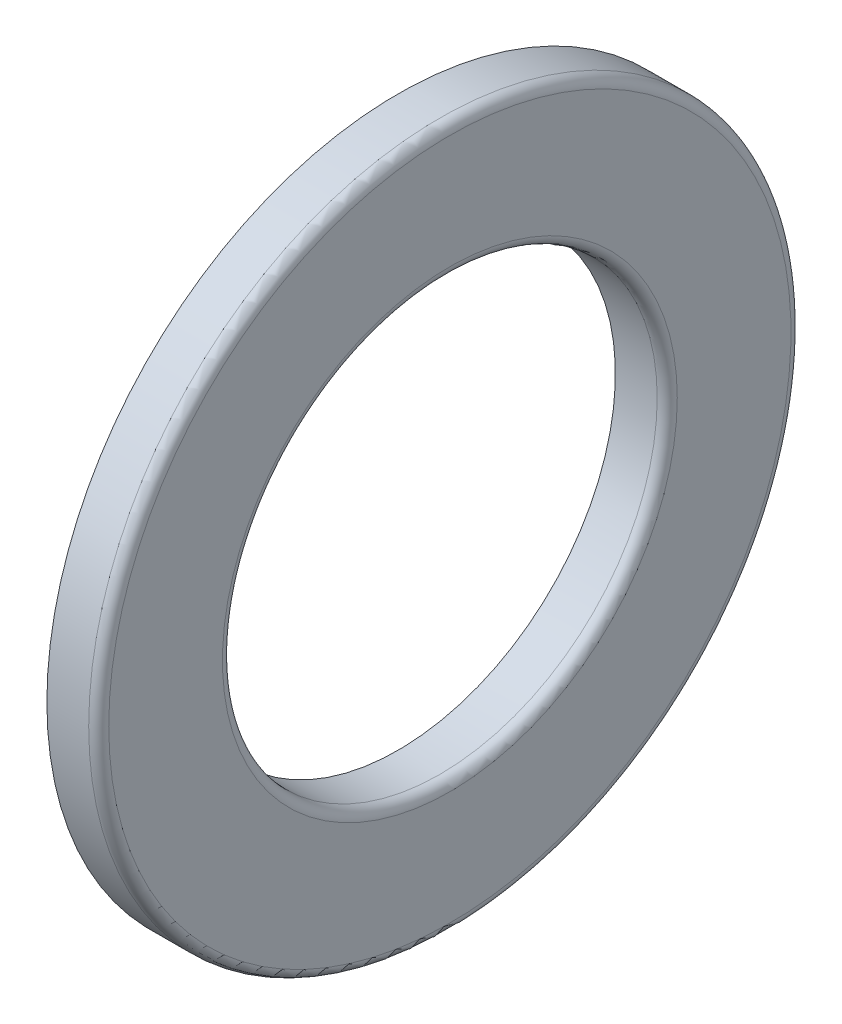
ISO-10303-21;
HEADER;
FILE_DESCRIPTION(('STEP AP214'),'2;1');
FILE_NAME('part.step','',(''),(''),'','','');
FILE_SCHEMA(('AUTOMOTIVE_DESIGN { 1 0 10303 214 1 1 1 1 }'));
ENDSEC;
DATA;
#1=APPLICATION_CONTEXT('core data for automotive mechanical design processes');
#2=APPLICATION_PROTOCOL_DEFINITION('international standard','automotive_design',2000,#1);
#3=PRODUCT_CONTEXT('',#1,'mechanical');
#4=PRODUCT('Part','Part','',(#3));
#5=PRODUCT_RELATED_PRODUCT_CATEGORY('part','',(#4));
#6=PRODUCT_DEFINITION_FORMATION('','',#4);
#7=PRODUCT_DEFINITION_CONTEXT('part definition',#1,'design');
#8=PRODUCT_DEFINITION('design','',#6,#7);
#9=PRODUCT_DEFINITION_SHAPE('','',#8);
#10=(LENGTH_UNIT() NAMED_UNIT(*) SI_UNIT(.MILLI.,.METRE.));
#11=(NAMED_UNIT(*) PLANE_ANGLE_UNIT() SI_UNIT($,.RADIAN.));
#12=(NAMED_UNIT(*) SI_UNIT($,.STERADIAN.) SOLID_ANGLE_UNIT());
#13=UNCERTAINTY_MEASURE_WITH_UNIT(LENGTH_MEASURE(1.E-05),#10,'distance_accuracy_value','');
#14=(GEOMETRIC_REPRESENTATION_CONTEXT(3) GLOBAL_UNCERTAINTY_ASSIGNED_CONTEXT((#13)) GLOBAL_UNIT_ASSIGNED_CONTEXT((#10,
#11,#12)) REPRESENTATION_CONTEXT('',''));
#15=CARTESIAN_POINT('',(0.,0.,0.));
#16=DIRECTION('',(0.,0.,1.));
#17=DIRECTION('',(1.,0.,0.));
#18=AXIS2_PLACEMENT_3D('',#15,#16,#17);
#19=CARTESIAN_POINT('',(7.9,-21.3901032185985,-21.));
#20=DIRECTION('',(-1.,0.,0.));
#21=DIRECTION('',(0.,0.,1.));
#22=AXIS2_PLACEMENT_3D('',#19,#20,#21);
#23=PLANE('',#22);
#24=CARTESIAN_POINT('',(7.9,0.,0.));
#25=DIRECTION('',(-1.,0.,0.));
#26=DIRECTION('',(0.,0.,-1.));
#27=AXIS2_PLACEMENT_3D('',#24,#25,#26);
#28=CIRCLE('',#27,21.);
#29=CARTESIAN_POINT('',(7.9,0.,-21.));
#30=VERTEX_POINT('',#29);
#31=EDGE_CURVE('E44',#30,#30,#28,.F.);
#32=ORIENTED_EDGE('',*,*,#31,.F.);
#33=EDGE_LOOP('',(#32));
#34=FACE_BOUND('',#33,.T.);
#35=CARTESIAN_POINT('',(7.9,0.,0.));
#36=DIRECTION('',(1.,0.,0.));
#37=DIRECTION('',(0.,-1.16846761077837E-09,1.));
#38=AXIS2_PLACEMENT_3D('',#35,#36,#37);
#39=CIRCLE('',#38,18.55);
#40=CARTESIAN_POINT('',(7.9,-2.16750741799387E-08,18.55));
#41=VERTEX_POINT('',#40);
#42=EDGE_CURVE('E41',#41,#41,#39,.T.);
#43=ORIENTED_EDGE('',*,*,#42,.T.);
#44=EDGE_LOOP('',(#43));
#45=FACE_BOUND('',#44,.T.);
#46=ADVANCED_FACE('F15',(#34,#45),#23,.T.);
#47=CARTESIAN_POINT('',(11.,-20.7789574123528,20.4));
#48=DIRECTION('',(1.,0.,0.));
#49=DIRECTION('',(0.,0.,-1.));
#50=AXIS2_PLACEMENT_3D('',#47,#48,#49);
#51=PLANE('',#50);
#52=CARTESIAN_POINT('',(11.,0.,0.));
#53=DIRECTION('',(1.,0.,0.));
#54=DIRECTION('',(0.,0.,1.));
#55=AXIS2_PLACEMENT_3D('',#52,#53,#54);
#56=CIRCLE('',#55,20.4);
#57=CARTESIAN_POINT('',(11.,0.,20.4));
#58=VERTEX_POINT('',#57);
#59=EDGE_CURVE('E38',#58,#58,#56,.T.);
#60=ORIENTED_EDGE('',*,*,#59,.T.);
#61=EDGE_LOOP('',(#60));
#62=FACE_BOUND('',#61,.T.);
#63=CARTESIAN_POINT('',(11.,0.,0.));
#64=DIRECTION('',(-1.,0.,0.));
#65=DIRECTION('',(0.,0.,-1.));
#66=AXIS2_PLACEMENT_3D('',#63,#64,#65);
#67=CIRCLE('',#66,13.6);
#68=CARTESIAN_POINT('',(11.,0.,-13.6));
#69=VERTEX_POINT('',#68);
#70=EDGE_CURVE('E35',#69,#69,#67,.F.);
#71=ORIENTED_EDGE('',*,*,#70,.F.);
#72=EDGE_LOOP('',(#71));
#73=FACE_BOUND('',#72,.T.);
#74=ADVANCED_FACE('F53',(#62,#73),#51,.T.);
#75=CARTESIAN_POINT('',(7.9,-15.2277163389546,-14.95));
#76=DIRECTION('',(-1.,0.,0.));
#77=DIRECTION('',(0.,0.,1.));
#78=AXIS2_PLACEMENT_3D('',#75,#76,#77);
#79=PLANE('',#78);
#80=CARTESIAN_POINT('',(7.9,0.,0.));
#81=DIRECTION('',(-1.,0.,0.));
#82=DIRECTION('',(0.,0.,-1.));
#83=AXIS2_PLACEMENT_3D('',#80,#81,#82);
#84=CIRCLE('',#83,14.95);
#85=CARTESIAN_POINT('',(7.9,0.,-14.95));
#86=VERTEX_POINT('',#85);
#87=EDGE_CURVE('E30',#86,#86,#84,.F.);
#88=ORIENTED_EDGE('',*,*,#87,.F.);
#89=EDGE_LOOP('',(#88));
#90=FACE_BOUND('',#89,.T.);
#91=CARTESIAN_POINT('',(7.9,0.,0.));
#92=DIRECTION('',(1.,0.,0.));
#93=DIRECTION('',(0.,0.,1.));
#94=AXIS2_PLACEMENT_3D('',#91,#92,#93);
#95=CIRCLE('',#94,13.);
#96=CARTESIAN_POINT('',(7.9,0.,13.));
#97=VERTEX_POINT('',#96);
#98=EDGE_CURVE('E26',#97,#97,#95,.T.);
#99=ORIENTED_EDGE('',*,*,#98,.T.);
#100=EDGE_LOOP('',(#99));
#101=FACE_BOUND('',#100,.T.);
#102=ADVANCED_FACE('F60',(#90,#101),#79,.T.);
#103=CARTESIAN_POINT('',(5.5,0.,0.));
#104=DIRECTION('',(1.,0.,0.));
#105=DIRECTION('',(0.,0.,1.));
#106=AXIS2_PLACEMENT_3D('',#103,#104,#105);
#107=TOROIDAL_SURFACE('',#106,16.75,3.);
#108=ORIENTED_EDGE('',*,*,#42,.F.);
#109=EDGE_LOOP('',(#108));
#110=FACE_BOUND('',#109,.T.);
#111=ORIENTED_EDGE('',*,*,#87,.T.);
#112=EDGE_LOOP('',(#111));
#113=FACE_BOUND('',#112,.T.);
#114=ADVANCED_FACE('F57',(#110,#113),#107,.F.);
#115=CARTESIAN_POINT('',(10.4,0.,0.));
#116=DIRECTION('',(1.,0.,0.));
#117=DIRECTION('',(0.,1.92332050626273E-10,1.));
#118=AXIS2_PLACEMENT_3D('',#115,#116,#117);
#119=CYLINDRICAL_SURFACE('',#118,21.);
#120=ORIENTED_EDGE('',*,*,#31,.T.);
#121=EDGE_LOOP('',(#120));
#122=FACE_BOUND('',#121,.T.);
#123=CARTESIAN_POINT('',(10.4,0.,0.));
#124=DIRECTION('',(-1.,0.,0.));
#125=DIRECTION('',(0.,0.,-1.));
#126=AXIS2_PLACEMENT_3D('',#123,#124,#125);
#127=CIRCLE('',#126,21.);
#128=CARTESIAN_POINT('',(10.4,0.,-21.));
#129=VERTEX_POINT('',#128);
#130=EDGE_CURVE('E22',#129,#129,#127,.F.);
#131=ORIENTED_EDGE('',*,*,#130,.F.);
#132=EDGE_LOOP('',(#131));
#133=FACE_BOUND('',#132,.T.);
#134=ADVANCED_FACE('F48',(#122,#133),#119,.T.);
#135=CARTESIAN_POINT('',(10.4000000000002,0.,0.));
#136=DIRECTION('',(1.,0.,0.));
#137=DIRECTION('',(0.,1.92332050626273E-10,1.));
#138=AXIS2_PLACEMENT_3D('',#135,#136,#137);
#139=TOROIDAL_SURFACE('',#138,20.4000000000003,0.599999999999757);
#140=ORIENTED_EDGE('',*,*,#130,.T.);
#141=EDGE_LOOP('',(#140));
#142=FACE_BOUND('',#141,.T.);
#143=ORIENTED_EDGE('',*,*,#59,.F.);
#144=EDGE_LOOP('',(#143));
#145=FACE_BOUND('',#144,.T.);
#146=ADVANCED_FACE('F75',(#142,#145),#139,.T.);
#147=CARTESIAN_POINT('',(10.4000000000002,0.,0.));
#148=DIRECTION('',(1.,0.,0.));
#149=DIRECTION('',(0.,1.92328053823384E-10,1.));
#150=AXIS2_PLACEMENT_3D('',#147,#148,#149);
#151=TOROIDAL_SURFACE('',#150,13.5999999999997,0.59999999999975);
#152=ORIENTED_EDGE('',*,*,#70,.T.);
#153=EDGE_LOOP('',(#152));
#154=FACE_BOUND('',#153,.T.);
#155=CARTESIAN_POINT('',(10.4,0.,0.));
#156=DIRECTION('',(-1.,0.,0.));
#157=DIRECTION('',(0.,0.,-1.));
#158=AXIS2_PLACEMENT_3D('',#155,#156,#157);
#159=CIRCLE('',#158,13.);
#160=CARTESIAN_POINT('',(10.4,0.,-13.));
#161=VERTEX_POINT('',#160);
#162=EDGE_CURVE('E10',#161,#161,#159,.F.);
#163=ORIENTED_EDGE('',*,*,#162,.F.);
#164=EDGE_LOOP('',(#163));
#165=FACE_BOUND('',#164,.T.);
#166=ADVANCED_FACE('F70',(#154,#165),#151,.T.);
#167=CARTESIAN_POINT('',(10.4,0.,0.));
#168=DIRECTION('',(1.,0.,0.));
#169=DIRECTION('',(0.,7.69311847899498E-10,1.));
#170=AXIS2_PLACEMENT_3D('',#167,#168,#169);
#171=CYLINDRICAL_SURFACE('',#170,13.);
#172=ORIENTED_EDGE('',*,*,#162,.T.);
#173=EDGE_LOOP('',(#172));
#174=FACE_BOUND('',#173,.T.);
#175=ORIENTED_EDGE('',*,*,#98,.F.);
#176=EDGE_LOOP('',(#175));
#177=FACE_BOUND('',#176,.T.);
#178=ADVANCED_FACE('F17',(#174,#177),#171,.F.);
#179=CLOSED_SHELL('',(#46,#74,#102,#114,#134,#146,#166,#178));
#180=MANIFOLD_SOLID_BREP('B1',#179);
#181=ADVANCED_BREP_SHAPE_REPRESENTATION('',(#18,#180),#14);
#182=SHAPE_DEFINITION_REPRESENTATION(#9,#181);
ENDSEC;
END-ISO-10303-21;
